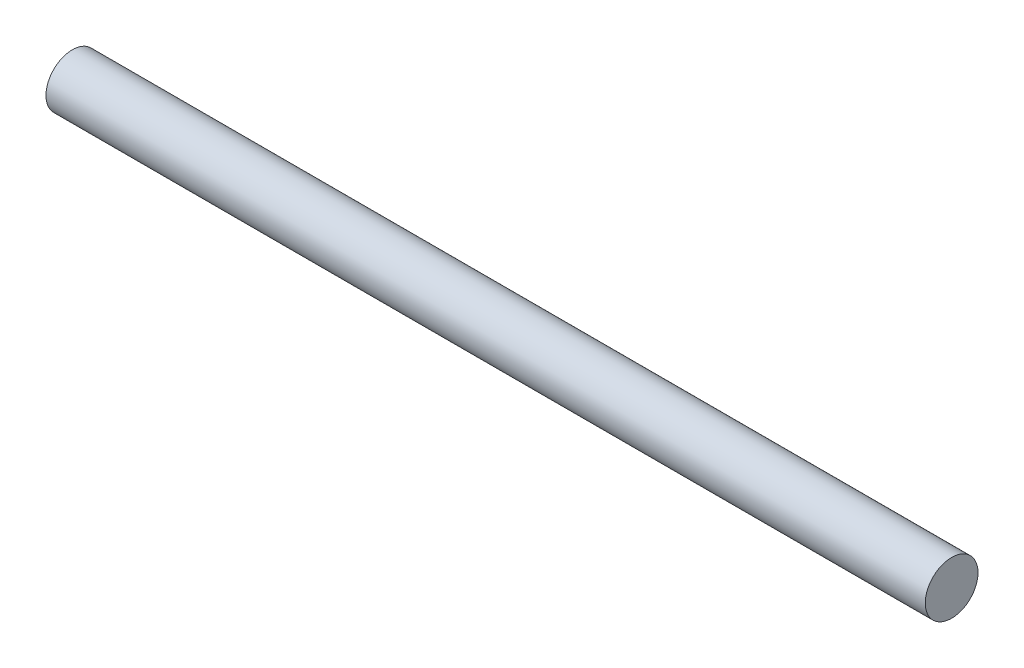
ISO-10303-21;
HEADER;
FILE_DESCRIPTION(('STEP AP214'),'2;1');
FILE_NAME('part.step','',(''),(''),'','','');
FILE_SCHEMA(('AUTOMOTIVE_DESIGN { 1 0 10303 214 1 1 1 1 }'));
ENDSEC;
DATA;
#1=APPLICATION_CONTEXT('core data for automotive mechanical design processes');
#2=APPLICATION_PROTOCOL_DEFINITION('international standard','automotive_design',2000,#1);
#3=PRODUCT_CONTEXT('',#1,'mechanical');
#4=PRODUCT('Part','Part','',(#3));
#5=PRODUCT_RELATED_PRODUCT_CATEGORY('part','',(#4));
#6=PRODUCT_DEFINITION_FORMATION('','',#4);
#7=PRODUCT_DEFINITION_CONTEXT('part definition',#1,'design');
#8=PRODUCT_DEFINITION('design','',#6,#7);
#9=PRODUCT_DEFINITION_SHAPE('','',#8);
#10=(LENGTH_UNIT() NAMED_UNIT(*) SI_UNIT(.MILLI.,.METRE.));
#11=(NAMED_UNIT(*) PLANE_ANGLE_UNIT() SI_UNIT($,.RADIAN.));
#12=(NAMED_UNIT(*) SI_UNIT($,.STERADIAN.) SOLID_ANGLE_UNIT());
#13=UNCERTAINTY_MEASURE_WITH_UNIT(LENGTH_MEASURE(1.E-05),#10,'distance_accuracy_value','');
#14=(GEOMETRIC_REPRESENTATION_CONTEXT(3) GLOBAL_UNCERTAINTY_ASSIGNED_CONTEXT((#13)) GLOBAL_UNIT_ASSIGNED_CONTEXT((#10,
#11,#12)) REPRESENTATION_CONTEXT('',''));
#15=CARTESIAN_POINT('',(0.,0.,0.));
#16=DIRECTION('',(0.,0.,1.));
#17=DIRECTION('',(1.,0.,0.));
#18=AXIS2_PLACEMENT_3D('',#15,#16,#17);
#19=CARTESIAN_POINT('',(125.,0.,0.));
#20=DIRECTION('',(-1.,0.,0.));
#21=DIRECTION('',(0.,0.,1.));
#22=AXIS2_PLACEMENT_3D('',#19,#20,#21);
#23=CYLINDRICAL_SURFACE('',#22,7.5);
#24=CARTESIAN_POINT('',(125.,0.,0.));
#25=DIRECTION('',(1.,0.,0.));
#26=DIRECTION('',(0.,0.,-1.));
#27=AXIS2_PLACEMENT_3D('',#24,#25,#26);
#28=CIRCLE('',#27,7.5);
#29=CARTESIAN_POINT('',(125.,0.,-7.5));
#30=VERTEX_POINT('',#29);
#31=EDGE_CURVE('E10',#30,#30,#28,.T.);
#32=ORIENTED_EDGE('',*,*,#31,.F.);
#33=EDGE_LOOP('',(#32));
#34=FACE_BOUND('',#33,.T.);
#35=CARTESIAN_POINT('',(-125.,0.,0.));
#36=DIRECTION('',(1.,0.,0.));
#37=DIRECTION('',(0.,0.,-1.));
#38=AXIS2_PLACEMENT_3D('',#35,#36,#37);
#39=CIRCLE('',#38,7.5);
#40=CARTESIAN_POINT('',(-125.,0.,-7.5));
#41=VERTEX_POINT('',#40);
#42=EDGE_CURVE('E37',#41,#41,#39,.T.);
#43=ORIENTED_EDGE('',*,*,#42,.T.);
#44=EDGE_LOOP('',(#43));
#45=FACE_BOUND('',#44,.T.);
#46=ADVANCED_FACE('F34',(#34,#45),#23,.T.);
#47=CARTESIAN_POINT('',(125.,0.,0.));
#48=DIRECTION('',(1.,0.,0.));
#49=DIRECTION('',(0.,0.,-1.));
#50=AXIS2_PLACEMENT_3D('',#47,#48,#49);
#51=PLANE('',#50);
#52=ORIENTED_EDGE('',*,*,#31,.T.);
#53=EDGE_LOOP('',(#52));
#54=FACE_BOUND('',#53,.T.);
#55=ADVANCED_FACE('F49',(#54),#51,.T.);
#56=CARTESIAN_POINT('',(-125.,0.,0.));
#57=DIRECTION('',(1.,0.,0.));
#58=DIRECTION('',(0.,0.,-1.));
#59=AXIS2_PLACEMENT_3D('',#56,#57,#58);
#60=PLANE('',#59);
#61=ORIENTED_EDGE('',*,*,#42,.F.);
#62=EDGE_LOOP('',(#61));
#63=FACE_BOUND('',#62,.T.);
#64=ADVANCED_FACE('F47',(#63),#60,.F.);
#65=CLOSED_SHELL('',(#46,#55,#64));
#66=MANIFOLD_SOLID_BREP('B2',#65);
#67=ADVANCED_BREP_SHAPE_REPRESENTATION('',(#18,#66),#14);
#68=SHAPE_DEFINITION_REPRESENTATION(#9,#67);
ENDSEC;
END-ISO-10303-21;
